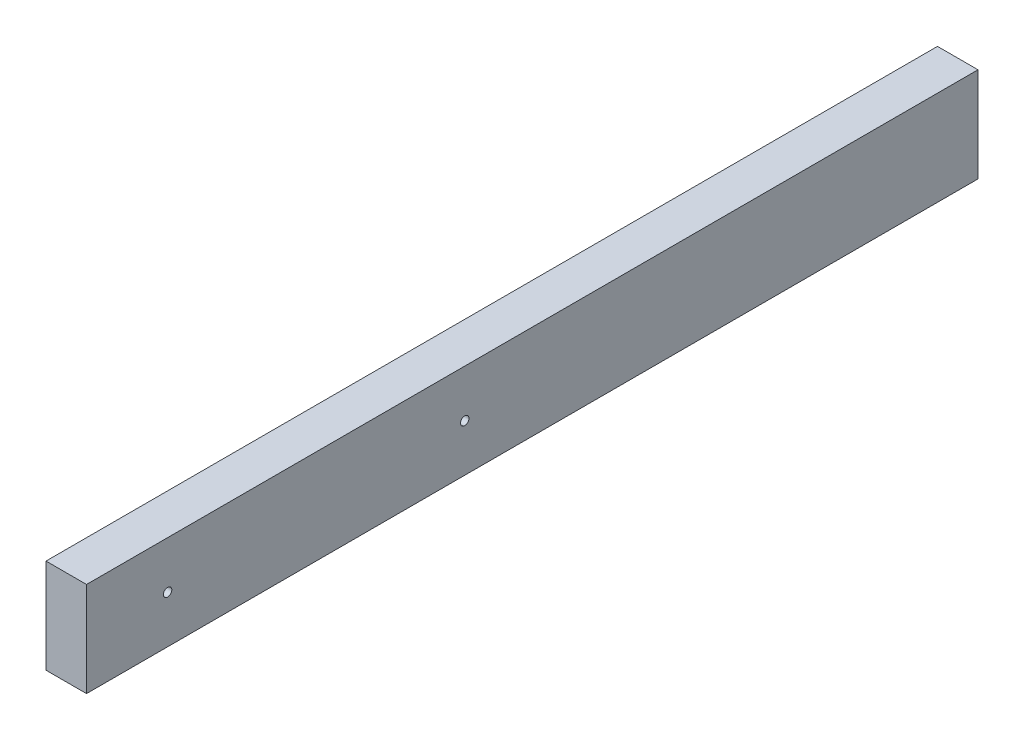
from build123d import *

# Parameters (mm, degrees)
SKETCH1_W                      = 38.1
SKETCH1_H                      = 88.9
BOSS_EXTRUDE1_DEPTH            = 838.2
F_5_16_0_3125_DIAMETER_HOLE1_D = 7.9375


with BuildPart() as part:
    # Sketch1 → Boss-Extrude1 (new body)
    with BuildSketch(Plane.XY):
        Rectangle(SKETCH1_W, SKETCH1_H)
    extrude(amount=BOSS_EXTRUDE1_DEPTH)

    # 5_16 _0.3125_ Diameter Hole1 (through all)
    with Locations(Plane(origin=(19.05, 0, 0), x_dir=(0, 0, -1), z_dir=(1, 0, 0))):
        with Locations((-482.6, 0), (-762, 0)):
            Hole(F_5_16_0_3125_DIAMETER_HOLE1_D / 2)


solid = part.part
